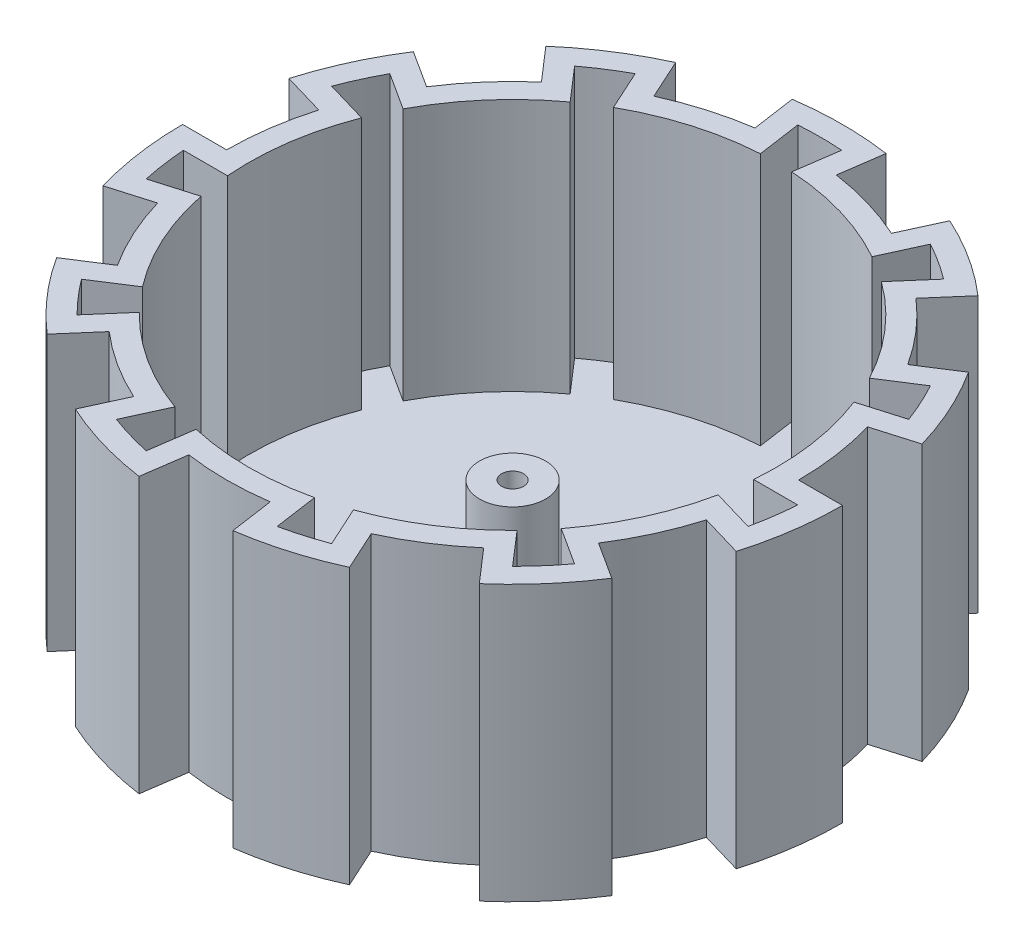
from build123d import *

# Parameters (mm, degrees)
SKETCH1_R           = 1.27
BOSS_EXTRUDE1_DEPTH = 31.75
SHELL1_T            = -2.54
CUT_EXTRUDE1_START  = -16.51
SKETCH2_R           = 3.81
CUT_EXTRUDE1_DEPTH  = 16.51


with BuildPart() as part:
    # Sketch1 → Boss-Extrude1 (new body)
    with BuildSketch(Plane(origin=(0, 0, 0), x_dir=(1, 0, 0), z_dir=(0, 1, 0))):
        with BuildLine():
            Line((-38.1, 0), (-33.02, 0))
            ThreePointArc((-33.02, 0), (-32.683904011, 4.69923596), (-31.682457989, 9.302809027))
            Line((-31.682457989, 9.302809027), (-36.556682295, 10.734010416))
            ThreePointArc((-36.556682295, 10.734010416), (-34.656979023, 15.827311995), (-32.051759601, 20.598415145))
            Line((-32.051759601, 20.598415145), (-27.778191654, 17.851959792))
            ThreePointArc((-27.778191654, 17.851959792), (-24.954850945, 21.623501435), (-21.623501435, 24.954850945))
            Line((-21.623501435, 24.954850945), (-24.950193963, 28.794058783))
            ThreePointArc((-24.950193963, 28.794058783), (-20.598415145, 32.051759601), (-15.827311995, 34.656979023))
            Line((-15.827311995, 34.656979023), (-13.717003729, 30.036048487))
            ThreePointArc((-13.717003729, 30.036048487), (-9.302809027, 31.682457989), (-4.69923596, 32.683904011))
            Line((-4.69923596, 32.683904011), (-5.422195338, 37.712196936))
            ThreePointArc((-5.422195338, 37.712196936), (0, 38.1), (5.422195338, 37.712196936))
            Line((5.422195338, 37.712196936), (4.69923596, 32.683904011))
            ThreePointArc((4.69923596, 32.683904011), (9.302809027, 31.682457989), (13.717003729, 30.036048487))
            Line((13.717003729, 30.036048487), (15.827311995, 34.656979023))
            ThreePointArc((15.827311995, 34.656979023), (20.598415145, 32.051759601), (24.950193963, 28.794058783))
            Line((24.950193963, 28.794058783), (21.623501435, 24.954850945))
            ThreePointArc((21.623501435, 24.954850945), (24.954850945, 21.623501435), (27.778191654, 17.851959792))
            Line((27.778191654, 17.851959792), (32.051759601, 20.598415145))
            ThreePointArc((32.051759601, 20.598415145), (34.656979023, 15.827311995), (36.556682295, 10.734010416))
            Line((36.556682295, 10.734010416), (31.682457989, 9.302809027))
            ThreePointArc((31.682457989, 9.302809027), (32.683904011, 4.69923596), (33.02, 0))
            Line((33.02, 0), (38.1, 0))
            ThreePointArc((38.1, 0), (37.712196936, -5.422195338), (36.556682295, -10.734010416))
            Line((36.556682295, -10.734010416), (31.682457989, -9.302809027))
            ThreePointArc((31.682457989, -9.302809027), (30.036048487, -13.717003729), (27.778191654, -17.851959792))
            Line((27.778191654, -17.851959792), (32.051759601, -20.598415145))
            ThreePointArc((32.051759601, -20.598415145), (28.794058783, -24.950193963), (24.950193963, -28.794058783))
            Line((24.950193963, -28.794058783), (21.623501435, -24.954850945))
            ThreePointArc((21.623501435, -24.954850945), (17.851959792, -27.778191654), (13.717003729, -30.036048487))
            Line((13.717003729, -30.036048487), (15.827311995, -34.656979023))
            ThreePointArc((15.827311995, -34.656979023), (10.734010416, -36.556682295), (5.422195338, -37.712196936))
            Line((5.422195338, -37.712196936), (4.69923596, -32.683904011))
            ThreePointArc((4.69923596, -32.683904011), (0, -33.02), (-4.69923596, -32.683904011))
            Line((-4.69923596, -32.683904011), (-5.422195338, -37.712196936))
            ThreePointArc((-5.422195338, -37.712196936), (-10.734010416, -36.556682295), (-15.827311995, -34.656979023))
            Line((-15.827311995, -34.656979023), (-13.717003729, -30.036048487))
            ThreePointArc((-13.717003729, -30.036048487), (-17.851959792, -27.778191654), (-21.623501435, -24.954850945))
            Line((-21.623501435, -24.954850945), (-24.950193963, -28.794058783))
            ThreePointArc((-24.950193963, -28.794058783), (-28.794058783, -24.950193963), (-32.051759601, -20.598415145))
            Line((-32.051759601, -20.598415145), (-27.778191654, -17.851959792))
            ThreePointArc((-27.778191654, -17.851959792), (-30.036048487, -13.717003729), (-31.682457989, -9.302809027))
            Line((-31.682457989, -9.302809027), (-36.556682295, -10.734010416))
            ThreePointArc((-36.556682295, -10.734010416), (-37.712196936, -5.422195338), (-38.1, 0))
        make_face()
        with Locations(Location((0, 0, 0), (0, 0, 270))):
            Circle(SKETCH1_R, mode=Mode.SUBTRACT)
    extrude(amount=BOSS_EXTRUDE1_DEPTH)

    # Shell1
    shell1_openings = [part.faces().sort_by_distance(p)[0] for p in [
        (13.794401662, 31.75, 32.79304005),
    ]]
    offset(amount=SHELL1_T, openings=shell1_openings, kind=Kind.INTERSECTION)

    # Sketch2 → Cut-Extrude1 (cut)
    with BuildSketch(Plane(origin=(0, 31.75, 0), x_dir=(1, 0, 0), z_dir=(0, 1, 0)).offset(CUT_EXTRUDE1_START)):
        with Locations(Location((0, 0, 0), (0, 0, 270))):
            Circle(SKETCH2_R)
    extrude(amount=CUT_EXTRUDE1_DEPTH, mode=Mode.SUBTRACT)


solid = part.part
